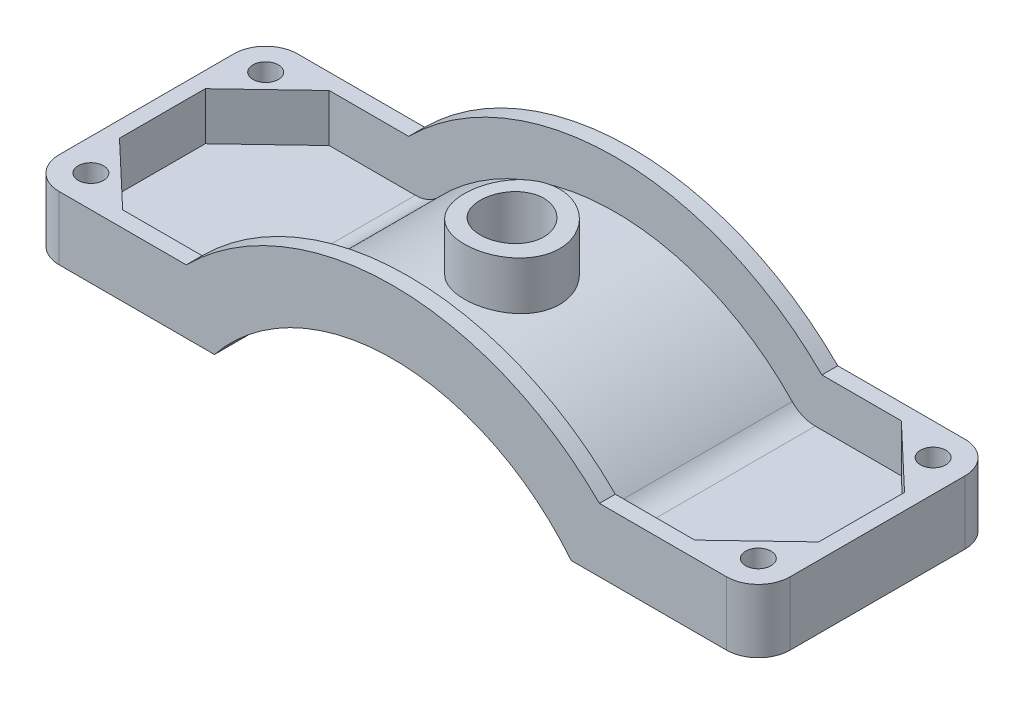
from build123d import *

# Parameters (mm, degrees)
EXTRUDE_THIN1_DEPTH     = 37.5
SKETCH7_R               = 10
CUT_EXTRUDE4_DEPTH      = 235.583569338
SHELL1_T                = -5
FILLET1_R               = 10
FILLET2_R               = 10
BOSS_EXTRUDE5_DEPTH     = 15
SKETCH5_R               = 4
CUT_EXTRUDE2_DEPTH      = 235.583569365
MIRROR3_COPY_1_DEPTH    = 15
MIRROR3_COPY_2_SKETCH_R = 4
MIRROR3_COPY_2_DEPTH    = 235.583569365


with BuildPart() as part:
    # Sketch1 → Extrude-Thin1 (new, symmetric)
    with BuildSketch(Plane.XY):
        with BuildLine():
            Line((0, 0), (50, 0))
            ThreePointArc((50, 0), (115, 26.892396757), (180, 0))
            Line((180, 0), (230, 0))
            Line((230, 0), (230, -20))
            Line((230, -20), (171.118661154, -20))
            ThreePointArc((171.118661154, -20), (115, 6.892396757), (58.881338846, -20))
            Line((58.881338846, -20), (0, -20))
            Line((0, -20), (0, 0))
        make_face()
    extrude(amount=EXTRUDE_THIN1_DEPTH, both=True)

    # Sketch7 → Cut-Extrude4 (cut, through all)
    with BuildSketch(Plane.XZ):
        with Locations(Location((115, 0, 0), (0, 0, 270))):
            Circle(SKETCH7_R)
    extrude(amount=-CUT_EXTRUDE4_DEPTH, mode=Mode.SUBTRACT)

    # Shell1
    shell1_openings = [part.faces().sort_by_distance(p)[0] for p in [
        (25, 0, 0),
        (117.233684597, 26.865276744, 9.747340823),
        (205, 0, 0),
    ]]
    offset(amount=SHELL1_T, openings=shell1_openings, kind=Kind.INTERSECTION)

    # Fillet1
    fillet1_edges = [part.edges().sort_by_distance(p)[0] for p in [
        (0, -10, 37.5),
        (230, -10, 37.5),
        (0, -10, -37.5),
        (230, -10, -37.5),
    ]]
    fillet(fillet1_edges, radius=FILLET1_R)

    # Fillet2
    fillet2_edges = [part.edges().sort_by_distance(p)[0] for p in [
        (173.465614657, -15, 0),
        (56.534385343, -15, 0),
    ]]
    fillet(fillet2_edges, radius=FILLET2_R)

    # Sketch9 → Boss-Extrude5 (add)
    with BuildSketch(Plane(origin=(0, -15, 0), x_dir=(1, 0, 0), z_dir=(0, 1, 0))):
        Polygon((25, 32.5), (5, 13.5), (5, 32.5), align=None)
    boss_extrude5 = extrude(amount=BOSS_EXTRUDE5_DEPTH)

    # Sketch5 → Cut-Extrude2 (cut, through all)
    with BuildSketch(Plane(origin=(0, 0, 0), x_dir=(1, 0, 0), z_dir=(0, 1, 0))):
        with Locations(Location((10, 27.5, 0), (0, 0, 270))):
            Circle(SKETCH5_R)
    cut_extrude2 = extrude(amount=-CUT_EXTRUDE2_DEPTH, mode=Mode.SUBTRACT)

    # Mirror2: Boss-Extrude5, Cut-Extrude2 across plane
    add(boss_extrude5.mirror(Plane.XY))
    add(cut_extrude2.mirror(Plane.XY), mode=Mode.SUBTRACT)

    # Mirror3: Boss-Extrude5, Cut-Extrude2 across plane
    add(boss_extrude5.mirror(Plane.ZY.offset(-115)))
    add(cut_extrude2.mirror(Plane.ZY.offset(-115)), mode=Mode.SUBTRACT)

    # Mirror3 copy 1 sketch → Mirror3 copy 1 (add)
    with BuildSketch(Plane(origin=(230, -15, 0), x_dir=(-1, 0, 0), z_dir=(0, 1, 0))):
        Polygon((25, 32.5), (5, 13.5), (5, 32.5), align=None)
    extrude(amount=MIRROR3_COPY_1_DEPTH)

    # Mirror3 copy 2 sketch → Mirror3 copy 2 (cut, through all)
    with BuildSketch(Plane(origin=(230, 0, 0), x_dir=(-1, 0, 0), z_dir=(0, 1, 0))):
        with Locations(Location((10, 27.5, 0), (0, 0, 270))):
            Circle(MIRROR3_COPY_2_SKETCH_R)
    extrude(amount=-MIRROR3_COPY_2_DEPTH, mode=Mode.SUBTRACT)


solid = part.part
